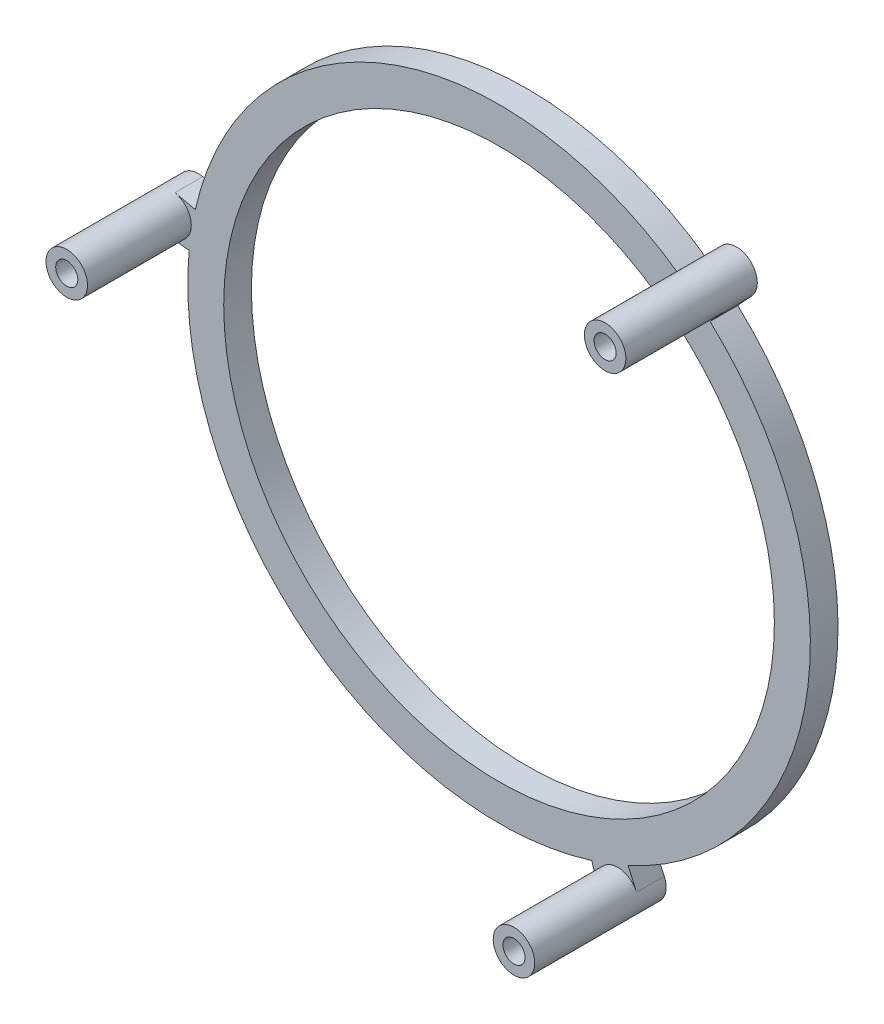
ISO-10303-21;
HEADER;
FILE_DESCRIPTION(('STEP AP214'),'2;1');
FILE_NAME('part.step','',(''),(''),'','','');
FILE_SCHEMA(('AUTOMOTIVE_DESIGN { 1 0 10303 214 1 1 1 1 }'));
ENDSEC;
DATA;
#1=APPLICATION_CONTEXT('core data for automotive mechanical design processes');
#2=APPLICATION_PROTOCOL_DEFINITION('international standard','automotive_design',2000,#1);
#3=PRODUCT_CONTEXT('',#1,'mechanical');
#4=PRODUCT('Part','Part','',(#3));
#5=PRODUCT_RELATED_PRODUCT_CATEGORY('part','',(#4));
#6=PRODUCT_DEFINITION_FORMATION('','',#4);
#7=PRODUCT_DEFINITION_CONTEXT('part definition',#1,'design');
#8=PRODUCT_DEFINITION('design','',#6,#7);
#9=PRODUCT_DEFINITION_SHAPE('','',#8);
#10=(LENGTH_UNIT() NAMED_UNIT(*) SI_UNIT(.MILLI.,.METRE.));
#11=(NAMED_UNIT(*) PLANE_ANGLE_UNIT() SI_UNIT($,.RADIAN.));
#12=(NAMED_UNIT(*) SI_UNIT($,.STERADIAN.) SOLID_ANGLE_UNIT());
#13=UNCERTAINTY_MEASURE_WITH_UNIT(LENGTH_MEASURE(1.E-05),#10,'distance_accuracy_value','');
#14=(GEOMETRIC_REPRESENTATION_CONTEXT(3) GLOBAL_UNCERTAINTY_ASSIGNED_CONTEXT((#13)) GLOBAL_UNIT_ASSIGNED_CONTEXT((#10,
#11,#12)) REPRESENTATION_CONTEXT('',''));
#15=CARTESIAN_POINT('',(0.,0.,0.));
#16=DIRECTION('',(0.,0.,1.));
#17=DIRECTION('',(1.,0.,0.));
#18=AXIS2_PLACEMENT_3D('',#15,#16,#17);
#19=CARTESIAN_POINT('',(8.52258154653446,-50.9418085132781,2.54));
#20=DIRECTION('',(0.,0.,1.));
#21=DIRECTION('',(1.,0.,0.));
#22=AXIS2_PLACEMENT_3D('',#19,#20,#21);
#23=PLANE('',#22);
#24=CARTESIAN_POINT('',(9.11384756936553,12.9608272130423,2.54));
#25=DIRECTION('',(0.,0.,1.));
#26=DIRECTION('',(1.,0.,0.));
#27=AXIS2_PLACEMENT_3D('',#24,#25,#26);
#28=CIRCLE('',#27,25.273);
#29=CARTESIAN_POINT('',(34.3868475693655,12.9608272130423,2.54));
#30=VERTEX_POINT('',#29);
#31=EDGE_CURVE('E228',#30,#30,#28,.T.);
#32=ORIENTED_EDGE('',*,*,#31,.F.);
#33=EDGE_LOOP('',(#32));
#34=FACE_BOUND('',#33,.T.);
#35=DIRECTION('',(0.677847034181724,0.735202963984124,0.));
#36=VECTOR('',#35,1.);
#37=CARTESIAN_POINT('',(-23.004032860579,-21.8747030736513,2.54));
#38=LINE('',#37,#36);
#39=CARTESIAN_POINT('',(28.4833265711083,33.9692519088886,2.54));
#40=VERTEX_POINT('',#39);
#41=CARTESIAN_POINT('',(29.7746251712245,35.3698135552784,2.54));
#42=VERTEX_POINT('',#41);
#43=EDGE_CURVE('E124',#40,#42,#38,.T.);
#44=ORIENTED_EDGE('',*,*,#43,.T.);
#45=CARTESIAN_POINT('',(28.3740635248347,36.6611121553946,2.54));
#46=DIRECTION('',(0.,0.,1.));
#47=DIRECTION('',(1.,0.,0.));
#48=AXIS2_PLACEMENT_3D('',#45,#46,#47);
#49=CIRCLE('',#48,1.905);
#50=CARTESIAN_POINT('',(26.8236169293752,37.7679727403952,2.54));
#51=VERTEX_POINT('',#50);
#52=EDGE_CURVE('E119',#51,#42,#49,.T.);
#53=ORIENTED_EDGE('',*,*,#52,.F.);
#54=DIRECTION('',(0.581029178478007,0.813882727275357,0.));
#55=VECTOR('',#54,1.);
#56=CARTESIAN_POINT('',(-21.3046534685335,-29.648207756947,2.54));
#57=LINE('',#56,#55);
#58=CARTESIAN_POINT('',(25.7167563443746,36.2175261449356,2.54));
#59=VERTEX_POINT('',#58);
#60=EDGE_CURVE('E122',#59,#51,#57,.T.);
#61=ORIENTED_EDGE('',*,*,#60,.F.);
#62=CARTESIAN_POINT('',(9.11384756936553,12.9608272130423,2.54));
#63=DIRECTION('',(0.,0.,1.));
#64=DIRECTION('',(1.,0.,0.));
#65=AXIS2_PLACEMENT_3D('',#62,#63,#64);
#66=CIRCLE('',#65,28.575);
#67=CARTESIAN_POINT('',(-18.7647214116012,19.2310757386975,2.54));
#68=VERTEX_POINT('',#67);
#69=EDGE_CURVE('E144',#59,#68,#66,.T.);
#70=ORIENTED_EDGE('',*,*,#69,.T.);
#71=DIRECTION('',(-0.97562796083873,0.219431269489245,0.));
#72=VECTOR('',#71,1.);
#73=CARTESIAN_POINT('',(22.2315370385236,10.0104902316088,2.54));
#74=LINE('',#73,#72);
#75=CARTESIAN_POINT('',(-20.623292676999,19.6490923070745,2.54));
#76=VERTEX_POINT('',#75);
#77=EDGE_CURVE('E146',#68,#76,#74,.T.);
#78=ORIENTED_EDGE('',*,*,#77,.T.);
#79=CARTESIAN_POINT('',(-21.041309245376,17.7905210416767,2.54));
#80=DIRECTION('',(0.,0.,1.));
#81=DIRECTION('',(1.,0.,0.));
#82=AXIS2_PLACEMENT_3D('',#79,#80,#81);
#83=CIRCLE('',#82,1.905);
#84=CARTESIAN_POINT('',(-21.2246553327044,15.8943646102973,2.54));
#85=VERTEX_POINT('',#84);
#86=EDGE_CURVE('E11',#76,#85,#83,.F.);
#87=ORIENTED_EDGE('',*,*,#86,.T.);
#88=DIRECTION('',(-0.995357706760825,0.0962446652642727,0.));
#89=VECTOR('',#88,1.);
#90=CARTESIAN_POINT('',(14.6497948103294,12.4255368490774,2.54));
#91=LINE('',#90,#89);
#92=CARTESIAN_POINT('',(-19.328498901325,15.7110185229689,2.54));
#93=VERTEX_POINT('',#92);
#94=EDGE_CURVE('E154',#93,#85,#91,.T.);
#95=ORIENTED_EDGE('',*,*,#94,.F.);
#96=CARTESIAN_POINT('',(17.6229375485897,-14.3178460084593,2.54));
#97=VERTEX_POINT('',#96);
#98=EDGE_CURVE('E149',#93,#97,#66,.T.);
#99=ORIENTED_EDGE('',*,*,#98,.T.);
#100=DIRECTION('',(0.297780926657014,-0.954634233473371,0.));
#101=VECTOR('',#100,1.);
#102=CARTESIAN_POINT('',(27.2271394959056,-45.1072591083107,2.54));
#103=LINE('',#102,#101);
#104=CARTESIAN_POINT('',(18.1902102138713,-16.1364242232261,2.54));
#105=VERTEX_POINT('',#104);
#106=EDGE_CURVE('E54',#97,#105,#103,.T.);
#107=ORIENTED_EDGE('',*,*,#106,.T.);
#108=CARTESIAN_POINT('',(20.0087884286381,-15.5691515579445,2.54));
#109=DIRECTION('',(0.,0.,1.));
#110=DIRECTION('',(1.,0.,0.));
#111=AXIS2_PLACEMENT_3D('',#108,#109,#110);
#112=CIRCLE('',#111,1.905);
#113=CARTESIAN_POINT('',(21.7425811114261,-14.7798557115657,2.54));
#114=VERTEX_POINT('',#113);
#115=EDGE_CURVE('E182',#114,#105,#112,.T.);
#116=ORIENTED_EDGE('',*,*,#115,.F.);
#117=DIRECTION('',(0.414328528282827,-0.91012739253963,0.));
#118=VECTOR('',#117,1.);
#119=CARTESIAN_POINT('',(33.1095023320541,-39.7488010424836,2.54));
#120=LINE('',#119,#118);
#121=CARTESIAN_POINT('',(20.9532852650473,-13.0460630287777,2.54));
#122=VERTEX_POINT('',#121);
#123=EDGE_CURVE('E159',#122,#114,#120,.T.);
#124=ORIENTED_EDGE('',*,*,#123,.F.);
#125=EDGE_CURVE('E148',#122,#40,#66,.T.);
#126=ORIENTED_EDGE('',*,*,#125,.T.);
#127=EDGE_LOOP('',(#44,#53,#61,#70,#78,#87,#95,#99,#107,#116,#124,#126));
#128=FACE_BOUND('',#127,.T.);
#129=ADVANCED_FACE('F31',(#34,#128),#23,.T.);
#130=CARTESIAN_POINT('',(9.11384756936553,12.9608272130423,2.54));
#131=DIRECTION('',(0.,0.,-1.));
#132=DIRECTION('',(-1.,0.,0.));
#133=AXIS2_PLACEMENT_3D('',#130,#131,#132);
#134=CYLINDRICAL_SURFACE('',#133,28.575);
#135=CARTESIAN_POINT('',(9.11384756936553,12.9608272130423,0.));
#136=DIRECTION('',(0.,0.,1.));
#137=DIRECTION('',(1.,0.,0.));
#138=AXIS2_PLACEMENT_3D('',#135,#136,#137);
#139=CIRCLE('',#138,28.575);
#140=CARTESIAN_POINT('',(20.9532852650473,-13.0460630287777,0.));
#141=VERTEX_POINT('',#140);
#142=CARTESIAN_POINT('',(28.4833265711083,33.9692519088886,0.));
#143=VERTEX_POINT('',#142);
#144=EDGE_CURVE('E192',#141,#143,#139,.T.);
#145=ORIENTED_EDGE('',*,*,#144,.T.);
#146=DIRECTION('',(0.,0.,-1.));
#147=VECTOR('',#146,1.);
#148=CARTESIAN_POINT('',(28.4833265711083,33.9692519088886,2.54));
#149=LINE('',#148,#147);
#150=EDGE_CURVE('E39',#40,#143,#149,.T.);
#151=ORIENTED_EDGE('',*,*,#150,.F.);
#152=ORIENTED_EDGE('',*,*,#125,.F.);
#153=DIRECTION('',(0.,0.,-1.));
#154=VECTOR('',#153,1.);
#155=CARTESIAN_POINT('',(20.9532852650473,-13.0460630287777,2.54));
#156=LINE('',#155,#154);
#157=EDGE_CURVE('E46',#122,#141,#156,.T.);
#158=ORIENTED_EDGE('',*,*,#157,.T.);
#159=EDGE_LOOP('',(#145,#151,#152,#158));
#160=FACE_BOUND('',#159,.T.);
#161=ADVANCED_FACE('F257',(#160),#134,.T.);
#162=CARTESIAN_POINT('',(-23.004032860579,-21.8747030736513,2.54));
#163=DIRECTION('',(-0.735202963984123,0.677847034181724,0.));
#164=DIRECTION('',(-0.677847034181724,-0.735202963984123,0.));
#165=AXIS2_PLACEMENT_3D('',#162,#163,#164);
#166=PLANE('',#165);
#167=DIRECTION('',(0.677847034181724,0.735202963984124,0.));
#168=VECTOR('',#167,1.);
#169=CARTESIAN_POINT('',(-23.004032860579,-21.8747030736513,0.));
#170=LINE('',#169,#168);
#171=CARTESIAN_POINT('',(29.7746251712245,35.3698135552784,0.));
#172=VERTEX_POINT('',#171);
#173=EDGE_CURVE('E195',#143,#172,#170,.T.);
#174=ORIENTED_EDGE('',*,*,#173,.T.);
#175=DIRECTION('',(0.,0.,-1.));
#176=VECTOR('',#175,1.);
#177=CARTESIAN_POINT('',(29.7746251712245,35.3698135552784,2.54));
#178=LINE('',#177,#176);
#179=EDGE_CURVE('E139',#42,#172,#178,.T.);
#180=ORIENTED_EDGE('',*,*,#179,.F.);
#181=ORIENTED_EDGE('',*,*,#43,.F.);
#182=ORIENTED_EDGE('',*,*,#150,.T.);
#183=EDGE_LOOP('',(#174,#180,#181,#182));
#184=FACE_BOUND('',#183,.T.);
#185=ADVANCED_FACE('F259',(#184),#166,.F.);
#186=CARTESIAN_POINT('',(28.3740635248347,36.6611121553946,2.54));
#187=DIRECTION('',(0.,0.,-1.));
#188=DIRECTION('',(-1.,0.,0.));
#189=AXIS2_PLACEMENT_3D('',#186,#187,#188);
#190=CYLINDRICAL_SURFACE('',#189,1.90499999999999);
#191=CARTESIAN_POINT('',(28.3740635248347,36.6611121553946,0.));
#192=DIRECTION('',(0.,0.,1.));
#193=DIRECTION('',(1.,0.,0.));
#194=AXIS2_PLACEMENT_3D('',#191,#192,#193);
#195=CIRCLE('',#194,1.90499999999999);
#196=CARTESIAN_POINT('',(26.8236169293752,37.7679727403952,0.));
#197=VERTEX_POINT('',#196);
#198=EDGE_CURVE('E135',#197,#172,#195,.F.);
#199=ORIENTED_EDGE('',*,*,#198,.F.);
#200=DIRECTION('',(0.,0.,-1.));
#201=VECTOR('',#200,1.);
#202=CARTESIAN_POINT('',(26.8236169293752,37.7679727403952,2.54));
#203=LINE('',#202,#201);
#204=EDGE_CURVE('E131',#51,#197,#203,.T.);
#205=ORIENTED_EDGE('',*,*,#204,.F.);
#206=ORIENTED_EDGE('',*,*,#52,.T.);
#207=ORIENTED_EDGE('',*,*,#179,.T.);
#208=EDGE_LOOP('',(#199,#205,#206,#207));
#209=FACE_BOUND('',#208,.T.);
#210=CARTESIAN_POINT('',(28.3740635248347,36.6611121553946,12.065));
#211=DIRECTION('',(0.,0.,1.));
#212=DIRECTION('',(1.,0.,0.));
#213=AXIS2_PLACEMENT_3D('',#210,#211,#212);
#214=CIRCLE('',#213,1.905);
#215=CARTESIAN_POINT('',(30.2790635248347,36.6611121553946,12.065));
#216=VERTEX_POINT('',#215);
#217=EDGE_CURVE('E127',#216,#216,#214,.T.);
#218=ORIENTED_EDGE('',*,*,#217,.F.);
#219=EDGE_LOOP('',(#218));
#220=FACE_BOUND('',#219,.T.);
#221=ADVANCED_FACE('F132',(#209,#220),#190,.T.);
#222=CARTESIAN_POINT('',(-21.3046534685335,-29.648207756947,2.54));
#223=DIRECTION('',(-0.813882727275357,0.581029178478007,0.));
#224=DIRECTION('',(-0.581029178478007,-0.813882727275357,0.));
#225=AXIS2_PLACEMENT_3D('',#222,#223,#224);
#226=PLANE('',#225);
#227=DIRECTION('',(0.581029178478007,0.813882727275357,0.));
#228=VECTOR('',#227,1.);
#229=CARTESIAN_POINT('',(-21.3046534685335,-29.648207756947,0.));
#230=LINE('',#229,#228);
#231=CARTESIAN_POINT('',(25.7167563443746,36.2175261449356,0.));
#232=VERTEX_POINT('',#231);
#233=EDGE_CURVE('E201',#232,#197,#230,.T.);
#234=ORIENTED_EDGE('',*,*,#233,.F.);
#235=DIRECTION('',(0.,0.,-1.));
#236=VECTOR('',#235,1.);
#237=CARTESIAN_POINT('',(25.7167563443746,36.2175261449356,2.54));
#238=LINE('',#237,#236);
#239=EDGE_CURVE('E140',#59,#232,#238,.T.);
#240=ORIENTED_EDGE('',*,*,#239,.F.);
#241=ORIENTED_EDGE('',*,*,#60,.T.);
#242=ORIENTED_EDGE('',*,*,#204,.T.);
#243=EDGE_LOOP('',(#234,#240,#241,#242));
#244=FACE_BOUND('',#243,.T.);
#245=ADVANCED_FACE('F142',(#244),#226,.T.);
#246=CARTESIAN_POINT('',(-18.7647214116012,19.2310757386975,0.));
#247=VERTEX_POINT('',#246);
#248=EDGE_CURVE('E197',#232,#247,#139,.T.);
#249=ORIENTED_EDGE('',*,*,#248,.T.);
#250=DIRECTION('',(0.,0.,-1.));
#251=VECTOR('',#250,1.);
#252=CARTESIAN_POINT('',(-18.7647214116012,19.2310757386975,2.54));
#253=LINE('',#252,#251);
#254=EDGE_CURVE('E171',#68,#247,#253,.T.);
#255=ORIENTED_EDGE('',*,*,#254,.F.);
#256=ORIENTED_EDGE('',*,*,#69,.F.);
#257=ORIENTED_EDGE('',*,*,#239,.T.);
#258=EDGE_LOOP('',(#249,#255,#256,#257));
#259=FACE_BOUND('',#258,.T.);
#260=ADVANCED_FACE('F281',(#259),#134,.T.);
#261=CARTESIAN_POINT('',(22.2315370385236,10.0104902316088,2.54));
#262=DIRECTION('',(-0.219431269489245,-0.97562796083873,0.));
#263=DIRECTION('',(0.97562796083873,-0.219431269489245,0.));
#264=AXIS2_PLACEMENT_3D('',#261,#262,#263);
#265=PLANE('',#264);
#266=DIRECTION('',(-0.97562796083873,0.219431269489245,0.));
#267=VECTOR('',#266,1.);
#268=CARTESIAN_POINT('',(22.2315370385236,10.0104902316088,0.));
#269=LINE('',#268,#267);
#270=CARTESIAN_POINT('',(-20.623292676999,19.6490923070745,0.));
#271=VERTEX_POINT('',#270);
#272=EDGE_CURVE('E203',#247,#271,#269,.T.);
#273=ORIENTED_EDGE('',*,*,#272,.T.);
#274=DIRECTION('',(0.,0.,-1.));
#275=VECTOR('',#274,1.);
#276=CARTESIAN_POINT('',(-20.623292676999,19.6490923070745,2.54));
#277=LINE('',#276,#275);
#278=EDGE_CURVE('E168',#76,#271,#277,.T.);
#279=ORIENTED_EDGE('',*,*,#278,.F.);
#280=ORIENTED_EDGE('',*,*,#77,.F.);
#281=ORIENTED_EDGE('',*,*,#254,.T.);
#282=EDGE_LOOP('',(#273,#279,#280,#281));
#283=FACE_BOUND('',#282,.T.);
#284=ADVANCED_FACE('F355',(#283),#265,.F.);
#285=CARTESIAN_POINT('',(-21.041309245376,17.7905210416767,2.54));
#286=DIRECTION('',(0.,0.,-1.));
#287=DIRECTION('',(-1.,0.,0.));
#288=AXIS2_PLACEMENT_3D('',#285,#286,#287);
#289=CYLINDRICAL_SURFACE('',#288,1.905);
#290=CARTESIAN_POINT('',(-21.041309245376,17.7905210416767,0.));
#291=DIRECTION('',(0.,0.,1.));
#292=DIRECTION('',(1.,0.,0.));
#293=AXIS2_PLACEMENT_3D('',#290,#291,#292);
#294=CIRCLE('',#293,1.905);
#295=CARTESIAN_POINT('',(-21.2246553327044,15.8943646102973,0.));
#296=VERTEX_POINT('',#295);
#297=EDGE_CURVE('E205',#271,#296,#294,.T.);
#298=ORIENTED_EDGE('',*,*,#297,.T.);
#299=DIRECTION('',(0.,0.,-1.));
#300=VECTOR('',#299,1.);
#301=CARTESIAN_POINT('',(-21.2246553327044,15.8943646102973,2.54));
#302=LINE('',#301,#300);
#303=EDGE_CURVE('E166',#85,#296,#302,.T.);
#304=ORIENTED_EDGE('',*,*,#303,.F.);
#305=ORIENTED_EDGE('',*,*,#86,.F.);
#306=ORIENTED_EDGE('',*,*,#278,.T.);
#307=EDGE_LOOP('',(#298,#304,#305,#306));
#308=FACE_BOUND('',#307,.T.);
#309=CARTESIAN_POINT('',(-21.041309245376,17.7905210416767,12.065));
#310=DIRECTION('',(0.,0.,1.));
#311=DIRECTION('',(1.,0.,0.));
#312=AXIS2_PLACEMENT_3D('',#309,#310,#311);
#313=CIRCLE('',#312,1.905);
#314=CARTESIAN_POINT('',(-19.136309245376,17.7905210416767,12.065));
#315=VERTEX_POINT('',#314);
#316=EDGE_CURVE('E345',#315,#315,#313,.T.);
#317=ORIENTED_EDGE('',*,*,#316,.F.);
#318=EDGE_LOOP('',(#317));
#319=FACE_BOUND('',#318,.T.);
#320=ADVANCED_FACE('F353',(#308,#319),#289,.T.);
#321=CARTESIAN_POINT('',(14.6497948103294,12.4255368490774,2.54));
#322=DIRECTION('',(-0.0962446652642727,-0.995357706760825,0.));
#323=DIRECTION('',(0.995357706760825,-0.0962446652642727,0.));
#324=AXIS2_PLACEMENT_3D('',#321,#322,#323);
#325=PLANE('',#324);
#326=DIRECTION('',(-0.995357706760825,0.0962446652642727,0.));
#327=VECTOR('',#326,1.);
#328=CARTESIAN_POINT('',(14.6497948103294,12.4255368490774,0.));
#329=LINE('',#328,#327);
#330=CARTESIAN_POINT('',(-19.328498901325,15.7110185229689,0.));
#331=VERTEX_POINT('',#330);
#332=EDGE_CURVE('E208',#331,#296,#329,.T.);
#333=ORIENTED_EDGE('',*,*,#332,.F.);
#334=DIRECTION('',(0.,0.,-1.));
#335=VECTOR('',#334,1.);
#336=CARTESIAN_POINT('',(-19.328498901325,15.7110185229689,2.54));
#337=LINE('',#336,#335);
#338=EDGE_CURVE('E163',#93,#331,#337,.T.);
#339=ORIENTED_EDGE('',*,*,#338,.F.);
#340=ORIENTED_EDGE('',*,*,#94,.T.);
#341=ORIENTED_EDGE('',*,*,#303,.T.);
#342=EDGE_LOOP('',(#333,#339,#340,#341));
#343=FACE_BOUND('',#342,.T.);
#344=ADVANCED_FACE('F279',(#343),#325,.T.);
#345=CARTESIAN_POINT('',(17.6229375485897,-14.3178460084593,0.));
#346=VERTEX_POINT('',#345);
#347=EDGE_CURVE('E196',#331,#346,#139,.T.);
#348=ORIENTED_EDGE('',*,*,#347,.T.);
#349=DIRECTION('',(0.,0.,-1.));
#350=VECTOR('',#349,1.);
#351=CARTESIAN_POINT('',(17.6229375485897,-14.3178460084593,2.54));
#352=LINE('',#351,#350);
#353=EDGE_CURVE('E160',#97,#346,#352,.T.);
#354=ORIENTED_EDGE('',*,*,#353,.F.);
#355=ORIENTED_EDGE('',*,*,#98,.F.);
#356=ORIENTED_EDGE('',*,*,#338,.T.);
#357=EDGE_LOOP('',(#348,#354,#355,#356));
#358=FACE_BOUND('',#357,.T.);
#359=ADVANCED_FACE('F267',(#358),#134,.T.);
#360=CARTESIAN_POINT('',(27.2271394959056,-45.1072591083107,2.54));
#361=DIRECTION('',(0.954634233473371,0.297780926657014,0.));
#362=DIRECTION('',(-0.297780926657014,0.954634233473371,0.));
#363=AXIS2_PLACEMENT_3D('',#360,#361,#362);
#364=PLANE('',#363);
#365=DIRECTION('',(0.297780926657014,-0.954634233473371,0.));
#366=VECTOR('',#365,1.);
#367=CARTESIAN_POINT('',(27.2271394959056,-45.1072591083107,0.));
#368=LINE('',#367,#366);
#369=CARTESIAN_POINT('',(18.1902102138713,-16.1364242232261,0.));
#370=VERTEX_POINT('',#369);
#371=EDGE_CURVE('E211',#346,#370,#368,.T.);
#372=ORIENTED_EDGE('',*,*,#371,.T.);
#373=DIRECTION('',(0.,0.,-1.));
#374=VECTOR('',#373,1.);
#375=CARTESIAN_POINT('',(18.1902102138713,-16.1364242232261,2.54));
#376=LINE('',#375,#374);
#377=EDGE_CURVE('E164',#105,#370,#376,.T.);
#378=ORIENTED_EDGE('',*,*,#377,.F.);
#379=ORIENTED_EDGE('',*,*,#106,.F.);
#380=ORIENTED_EDGE('',*,*,#353,.T.);
#381=EDGE_LOOP('',(#372,#378,#379,#380));
#382=FACE_BOUND('',#381,.T.);
#383=ADVANCED_FACE('F270',(#382),#364,.F.);
#384=CARTESIAN_POINT('',(20.0087884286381,-15.5691515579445,2.54));
#385=DIRECTION('',(0.,0.,-1.));
#386=DIRECTION('',(-1.,0.,0.));
#387=AXIS2_PLACEMENT_3D('',#384,#385,#386);
#388=CYLINDRICAL_SURFACE('',#387,1.905);
#389=CARTESIAN_POINT('',(20.0087884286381,-15.5691515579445,0.));
#390=DIRECTION('',(0.,0.,1.));
#391=DIRECTION('',(1.,0.,0.));
#392=AXIS2_PLACEMENT_3D('',#389,#390,#391);
#393=CIRCLE('',#392,1.905);
#394=CARTESIAN_POINT('',(21.7425811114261,-14.7798557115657,0.));
#395=VERTEX_POINT('',#394);
#396=EDGE_CURVE('E213',#370,#395,#393,.T.);
#397=ORIENTED_EDGE('',*,*,#396,.T.);
#398=DIRECTION('',(0.,0.,-1.));
#399=VECTOR('',#398,1.);
#400=CARTESIAN_POINT('',(21.7425811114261,-14.7798557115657,2.54));
#401=LINE('',#400,#399);
#402=EDGE_CURVE('E158',#114,#395,#401,.T.);
#403=ORIENTED_EDGE('',*,*,#402,.F.);
#404=ORIENTED_EDGE('',*,*,#115,.T.);
#405=ORIENTED_EDGE('',*,*,#377,.T.);
#406=EDGE_LOOP('',(#397,#403,#404,#405));
#407=FACE_BOUND('',#406,.T.);
#408=CARTESIAN_POINT('',(20.0087884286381,-15.5691515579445,12.065));
#409=DIRECTION('',(0.,0.,1.));
#410=DIRECTION('',(1.,0.,0.));
#411=AXIS2_PLACEMENT_3D('',#408,#409,#410);
#412=CIRCLE('',#411,1.905);
#413=CARTESIAN_POINT('',(21.9137884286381,-15.5691515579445,12.065));
#414=VERTEX_POINT('',#413);
#415=EDGE_CURVE('E186',#414,#414,#412,.T.);
#416=ORIENTED_EDGE('',*,*,#415,.F.);
#417=EDGE_LOOP('',(#416));
#418=FACE_BOUND('',#417,.T.);
#419=ADVANCED_FACE('F249',(#407,#418),#388,.T.);
#420=CARTESIAN_POINT('',(-21.041309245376,17.7905210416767,2.54));
#421=DIRECTION('',(0.,0.,-1.));
#422=DIRECTION('',(-1.,0.,0.));
#423=AXIS2_PLACEMENT_3D('',#420,#421,#422);
#424=CYLINDRICAL_SURFACE('',#423,1.016);
#425=CARTESIAN_POINT('',(-21.041309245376,17.7905210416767,0.));
#426=DIRECTION('',(0.,0.,1.));
#427=DIRECTION('',(1.,0.,0.));
#428=AXIS2_PLACEMENT_3D('',#425,#426,#427);
#429=CIRCLE('',#428,1.016);
#430=CARTESIAN_POINT('',(-20.025309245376,17.7905210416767,0.));
#431=VERTEX_POINT('',#430);
#432=EDGE_CURVE('E222',#431,#431,#429,.T.);
#433=ORIENTED_EDGE('',*,*,#432,.F.);
#434=EDGE_LOOP('',(#433));
#435=FACE_BOUND('',#434,.T.);
#436=CARTESIAN_POINT('',(-21.041309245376,17.7905210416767,12.065));
#437=DIRECTION('',(0.,0.,1.));
#438=DIRECTION('',(1.,0.,0.));
#439=AXIS2_PLACEMENT_3D('',#436,#437,#438);
#440=CIRCLE('',#439,1.016);
#441=CARTESIAN_POINT('',(-20.025309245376,17.7905210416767,12.065));
#442=VERTEX_POINT('',#441);
#443=EDGE_CURVE('E342',#442,#442,#440,.T.);
#444=ORIENTED_EDGE('',*,*,#443,.T.);
#445=EDGE_LOOP('',(#444));
#446=FACE_BOUND('',#445,.T.);
#447=ADVANCED_FACE('F277',(#435,#446),#424,.F.);
#448=CARTESIAN_POINT('',(20.0087884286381,-15.5691515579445,2.54));
#449=DIRECTION('',(0.,0.,-1.));
#450=DIRECTION('',(-1.,0.,0.));
#451=AXIS2_PLACEMENT_3D('',#448,#449,#450);
#452=CYLINDRICAL_SURFACE('',#451,1.016);
#453=CARTESIAN_POINT('',(20.0087884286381,-15.5691515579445,0.));
#454=DIRECTION('',(0.,0.,1.));
#455=DIRECTION('',(1.,0.,0.));
#456=AXIS2_PLACEMENT_3D('',#453,#454,#455);
#457=CIRCLE('',#456,1.016);
#458=CARTESIAN_POINT('',(21.0247884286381,-15.5691515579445,0.));
#459=VERTEX_POINT('',#458);
#460=EDGE_CURVE('E219',#459,#459,#457,.T.);
#461=ORIENTED_EDGE('',*,*,#460,.F.);
#462=EDGE_LOOP('',(#461));
#463=FACE_BOUND('',#462,.T.);
#464=CARTESIAN_POINT('',(20.0087884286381,-15.5691515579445,12.065));
#465=DIRECTION('',(0.,0.,1.));
#466=DIRECTION('',(1.,0.,0.));
#467=AXIS2_PLACEMENT_3D('',#464,#465,#466);
#468=CIRCLE('',#467,1.016);
#469=CARTESIAN_POINT('',(21.0247884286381,-15.5691515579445,12.065));
#470=VERTEX_POINT('',#469);
#471=EDGE_CURVE('E187',#470,#470,#468,.T.);
#472=ORIENTED_EDGE('',*,*,#471,.T.);
#473=EDGE_LOOP('',(#472));
#474=FACE_BOUND('',#473,.T.);
#475=ADVANCED_FACE('F298',(#463,#474),#452,.F.);
#476=CARTESIAN_POINT('',(33.1095023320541,-39.7488010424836,2.54));
#477=DIRECTION('',(0.91012739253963,0.414328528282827,0.));
#478=DIRECTION('',(-0.414328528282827,0.91012739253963,0.));
#479=AXIS2_PLACEMENT_3D('',#476,#477,#478);
#480=PLANE('',#479);
#481=DIRECTION('',(0.414328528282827,-0.91012739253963,0.));
#482=VECTOR('',#481,1.);
#483=CARTESIAN_POINT('',(33.1095023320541,-39.7488010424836,0.));
#484=LINE('',#483,#482);
#485=EDGE_CURVE('E216',#141,#395,#484,.T.);
#486=ORIENTED_EDGE('',*,*,#485,.F.);
#487=ORIENTED_EDGE('',*,*,#157,.F.);
#488=ORIENTED_EDGE('',*,*,#123,.T.);
#489=ORIENTED_EDGE('',*,*,#402,.T.);
#490=EDGE_LOOP('',(#486,#487,#488,#489));
#491=FACE_BOUND('',#490,.T.);
#492=ADVANCED_FACE('F248',(#491),#480,.T.);
#493=CARTESIAN_POINT('',(9.11384756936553,12.9608272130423,2.54));
#494=DIRECTION('',(0.,0.,-1.));
#495=DIRECTION('',(-1.,0.,0.));
#496=AXIS2_PLACEMENT_3D('',#493,#494,#495);
#497=CYLINDRICAL_SURFACE('',#496,25.273);
#498=ORIENTED_EDGE('',*,*,#31,.T.);
#499=EDGE_LOOP('',(#498));
#500=FACE_BOUND('',#499,.T.);
#501=CARTESIAN_POINT('',(9.11384756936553,12.9608272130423,0.));
#502=DIRECTION('',(0.,0.,1.));
#503=DIRECTION('',(1.,0.,0.));
#504=AXIS2_PLACEMENT_3D('',#501,#502,#503);
#505=CIRCLE('',#504,25.273);
#506=CARTESIAN_POINT('',(34.3868475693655,12.9608272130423,0.));
#507=VERTEX_POINT('',#506);
#508=EDGE_CURVE('E189',#507,#507,#505,.T.);
#509=ORIENTED_EDGE('',*,*,#508,.F.);
#510=EDGE_LOOP('',(#509));
#511=FACE_BOUND('',#510,.T.);
#512=ADVANCED_FACE('F33',(#500,#511),#497,.F.);
#513=CARTESIAN_POINT('',(28.3740635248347,36.6611121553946,2.54));
#514=DIRECTION('',(0.,0.,-1.));
#515=DIRECTION('',(-1.,0.,0.));
#516=AXIS2_PLACEMENT_3D('',#513,#514,#515);
#517=CYLINDRICAL_SURFACE('',#516,1.016);
#518=CARTESIAN_POINT('',(28.3740635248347,36.6611121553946,0.));
#519=DIRECTION('',(0.,0.,1.));
#520=DIRECTION('',(1.,0.,0.));
#521=AXIS2_PLACEMENT_3D('',#518,#519,#520);
#522=CIRCLE('',#521,1.016);
#523=CARTESIAN_POINT('',(29.3900635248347,36.6611121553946,0.));
#524=VERTEX_POINT('',#523);
#525=EDGE_CURVE('E225',#524,#524,#522,.T.);
#526=ORIENTED_EDGE('',*,*,#525,.F.);
#527=EDGE_LOOP('',(#526));
#528=FACE_BOUND('',#527,.T.);
#529=CARTESIAN_POINT('',(28.3740635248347,36.6611121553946,12.065));
#530=DIRECTION('',(0.,0.,1.));
#531=DIRECTION('',(1.,0.,0.));
#532=AXIS2_PLACEMENT_3D('',#529,#530,#531);
#533=CIRCLE('',#532,1.016);
#534=CARTESIAN_POINT('',(29.3900635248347,36.6611121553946,12.065));
#535=VERTEX_POINT('',#534);
#536=EDGE_CURVE('E128',#535,#535,#533,.T.);
#537=ORIENTED_EDGE('',*,*,#536,.T.);
#538=EDGE_LOOP('',(#537));
#539=FACE_BOUND('',#538,.T.);
#540=ADVANCED_FACE('F292',(#528,#539),#517,.F.);
#541=CARTESIAN_POINT('',(8.52258154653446,-50.9418085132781,0.));
#542=DIRECTION('',(0.,0.,1.));
#543=DIRECTION('',(1.,0.,0.));
#544=AXIS2_PLACEMENT_3D('',#541,#542,#543);
#545=PLANE('',#544);
#546=ORIENTED_EDGE('',*,*,#508,.T.);
#547=EDGE_LOOP('',(#546));
#548=FACE_BOUND('',#547,.T.);
#549=ORIENTED_EDGE('',*,*,#144,.F.);
#550=ORIENTED_EDGE('',*,*,#485,.T.);
#551=ORIENTED_EDGE('',*,*,#396,.F.);
#552=ORIENTED_EDGE('',*,*,#371,.F.);
#553=ORIENTED_EDGE('',*,*,#347,.F.);
#554=ORIENTED_EDGE('',*,*,#332,.T.);
#555=ORIENTED_EDGE('',*,*,#297,.F.);
#556=ORIENTED_EDGE('',*,*,#272,.F.);
#557=ORIENTED_EDGE('',*,*,#248,.F.);
#558=ORIENTED_EDGE('',*,*,#233,.T.);
#559=ORIENTED_EDGE('',*,*,#198,.T.);
#560=ORIENTED_EDGE('',*,*,#173,.F.);
#561=EDGE_LOOP('',(#549,#550,#551,#552,#553,#554,#555,#556,#557,#558,#559,#560));
#562=FACE_BOUND('',#561,.T.);
#563=ORIENTED_EDGE('',*,*,#460,.T.);
#564=EDGE_LOOP('',(#563));
#565=FACE_BOUND('',#564,.T.);
#566=ORIENTED_EDGE('',*,*,#432,.T.);
#567=EDGE_LOOP('',(#566));
#568=FACE_BOUND('',#567,.T.);
#569=ORIENTED_EDGE('',*,*,#525,.T.);
#570=EDGE_LOOP('',(#569));
#571=FACE_BOUND('',#570,.T.);
#572=ADVANCED_FACE('F254',(#548,#562,#565,#568,#571),#545,.F.);
#573=CARTESIAN_POINT('',(20.0087884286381,-15.5691515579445,12.065));
#574=DIRECTION('',(0.,0.,1.));
#575=DIRECTION('',(1.,0.,0.));
#576=AXIS2_PLACEMENT_3D('',#573,#574,#575);
#577=PLANE('',#576);
#578=ORIENTED_EDGE('',*,*,#415,.T.);
#579=EDGE_LOOP('',(#578));
#580=FACE_BOUND('',#579,.T.);
#581=ORIENTED_EDGE('',*,*,#471,.F.);
#582=EDGE_LOOP('',(#581));
#583=FACE_BOUND('',#582,.T.);
#584=ADVANCED_FACE('F314',(#580,#583),#577,.T.);
#585=CARTESIAN_POINT('',(-21.041309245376,17.7905210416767,12.065));
#586=DIRECTION('',(0.,0.,1.));
#587=DIRECTION('',(1.,0.,0.));
#588=AXIS2_PLACEMENT_3D('',#585,#586,#587);
#589=PLANE('',#588);
#590=ORIENTED_EDGE('',*,*,#316,.T.);
#591=EDGE_LOOP('',(#590));
#592=FACE_BOUND('',#591,.T.);
#593=ORIENTED_EDGE('',*,*,#443,.F.);
#594=EDGE_LOOP('',(#593));
#595=FACE_BOUND('',#594,.T.);
#596=ADVANCED_FACE('F318',(#592,#595),#589,.T.);
#597=CARTESIAN_POINT('',(28.3740635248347,36.6611121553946,12.065));
#598=DIRECTION('',(0.,0.,1.));
#599=DIRECTION('',(1.,0.,0.));
#600=AXIS2_PLACEMENT_3D('',#597,#598,#599);
#601=PLANE('',#600);
#602=ORIENTED_EDGE('',*,*,#217,.T.);
#603=EDGE_LOOP('',(#602));
#604=FACE_BOUND('',#603,.T.);
#605=ORIENTED_EDGE('',*,*,#536,.F.);
#606=EDGE_LOOP('',(#605));
#607=FACE_BOUND('',#606,.T.);
#608=ADVANCED_FACE('F323',(#604,#607),#601,.T.);
#609=CLOSED_SHELL('',(#129,#161,#185,#221,#245,#260,#284,#320,#344,#359,#383,#419,#447,#475,
#492,#512,#540,#572,#584,#596,#608));
#610=MANIFOLD_SOLID_BREP('B2',#609);
#611=ADVANCED_BREP_SHAPE_REPRESENTATION('',(#18,#610),#14);
#612=SHAPE_DEFINITION_REPRESENTATION(#9,#611);
ENDSEC;
END-ISO-10303-21;
